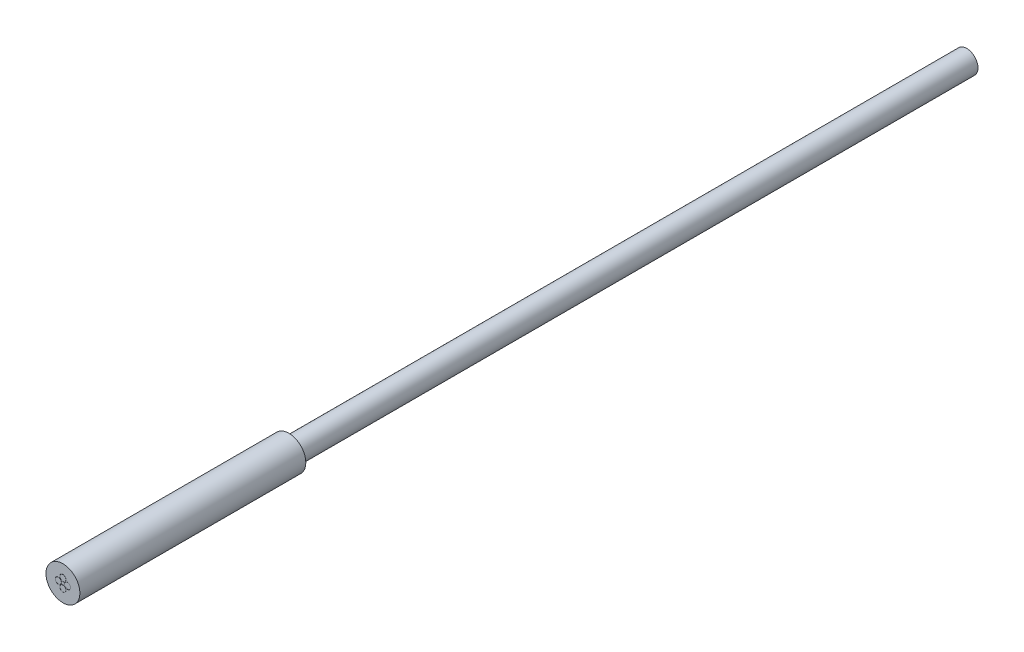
ISO-10303-21;
HEADER;
FILE_DESCRIPTION(('STEP AP214'),'2;1');
FILE_NAME('part.step','',(''),(''),'','','');
FILE_SCHEMA(('AUTOMOTIVE_DESIGN { 1 0 10303 214 1 1 1 1 }'));
ENDSEC;
DATA;
#1=APPLICATION_CONTEXT('core data for automotive mechanical design processes');
#2=APPLICATION_PROTOCOL_DEFINITION('international standard','automotive_design',2000,#1);
#3=PRODUCT_CONTEXT('',#1,'mechanical');
#4=PRODUCT('Part','Part','',(#3));
#5=PRODUCT_RELATED_PRODUCT_CATEGORY('part','',(#4));
#6=PRODUCT_DEFINITION_FORMATION('','',#4);
#7=PRODUCT_DEFINITION_CONTEXT('part definition',#1,'design');
#8=PRODUCT_DEFINITION('design','',#6,#7);
#9=PRODUCT_DEFINITION_SHAPE('','',#8);
#10=(LENGTH_UNIT() NAMED_UNIT(*) SI_UNIT(.MILLI.,.METRE.));
#11=(NAMED_UNIT(*) PLANE_ANGLE_UNIT() SI_UNIT($,.RADIAN.));
#12=(NAMED_UNIT(*) SI_UNIT($,.STERADIAN.) SOLID_ANGLE_UNIT());
#13=UNCERTAINTY_MEASURE_WITH_UNIT(LENGTH_MEASURE(1.E-05),#10,'distance_accuracy_value','');
#14=(GEOMETRIC_REPRESENTATION_CONTEXT(3) GLOBAL_UNCERTAINTY_ASSIGNED_CONTEXT((#13)) GLOBAL_UNIT_ASSIGNED_CONTEXT((#10,
#11,#12)) REPRESENTATION_CONTEXT('',''));
#15=CARTESIAN_POINT('',(0.,0.,0.));
#16=DIRECTION('',(0.,0.,1.));
#17=DIRECTION('',(1.,0.,0.));
#18=AXIS2_PLACEMENT_3D('',#15,#16,#17);
#19=CARTESIAN_POINT('',(0.,0.,-10.));
#20=DIRECTION('',(0.,0.,1.));
#21=DIRECTION('',(1.,0.,0.));
#22=AXIS2_PLACEMENT_3D('',#19,#20,#21);
#23=CYLINDRICAL_SURFACE('',#22,0.750000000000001);
#24=CARTESIAN_POINT('',(0.,0.,-10.));
#25=DIRECTION('',(0.,0.,1.));
#26=DIRECTION('',(1.,0.,0.));
#27=AXIS2_PLACEMENT_3D('',#24,#25,#26);
#28=CIRCLE('',#27,0.750000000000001);
#29=CARTESIAN_POINT('',(0.750000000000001,0.,-10.));
#30=VERTEX_POINT('',#29);
#31=EDGE_CURVE('E41',#30,#30,#28,.T.);
#32=ORIENTED_EDGE('',*,*,#31,.T.);
#33=EDGE_LOOP('',(#32));
#34=FACE_BOUND('',#33,.T.);
#35=CARTESIAN_POINT('',(0.,0.,0.));
#36=DIRECTION('',(0.,0.,1.));
#37=DIRECTION('',(1.,0.,0.));
#38=AXIS2_PLACEMENT_3D('',#35,#36,#37);
#39=CIRCLE('',#38,0.750000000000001);
#40=CARTESIAN_POINT('',(0.750000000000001,0.,0.));
#41=VERTEX_POINT('',#40);
#42=EDGE_CURVE('E37',#41,#41,#39,.T.);
#43=ORIENTED_EDGE('',*,*,#42,.F.);
#44=EDGE_LOOP('',(#43));
#45=FACE_BOUND('',#44,.T.);
#46=ADVANCED_FACE('F34',(#34,#45),#23,.T.);
#47=CARTESIAN_POINT('',(0.,0.,-10.));
#48=DIRECTION('',(0.,0.,1.));
#49=DIRECTION('',(1.,0.,0.));
#50=AXIS2_PLACEMENT_3D('',#47,#48,#49);
#51=PLANE('',#50);
#52=CARTESIAN_POINT('',(0.,0.,-10.));
#53=DIRECTION('',(0.,0.,-1.));
#54=DIRECTION('',(-1.,0.,0.));
#55=AXIS2_PLACEMENT_3D('',#52,#53,#54);
#56=CIRCLE('',#55,0.5);
#57=CARTESIAN_POINT('',(-0.5,0.,-10.));
#58=VERTEX_POINT('',#57);
#59=EDGE_CURVE('E10',#58,#58,#56,.T.);
#60=ORIENTED_EDGE('',*,*,#59,.F.);
#61=EDGE_LOOP('',(#60));
#62=FACE_BOUND('',#61,.T.);
#63=ORIENTED_EDGE('',*,*,#31,.F.);
#64=EDGE_LOOP('',(#63));
#65=FACE_BOUND('',#64,.T.);
#66=ADVANCED_FACE('F119',(#62,#65),#51,.F.);
#67=CARTESIAN_POINT('',(0.,0.,0.));
#68=DIRECTION('',(0.,0.,1.));
#69=DIRECTION('',(1.,0.,0.));
#70=AXIS2_PLACEMENT_3D('',#67,#68,#69);
#71=PLANE('',#70);
#72=CARTESIAN_POINT('',(0.,-0.201525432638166,0.));
#73=DIRECTION('',(0.,0.,1.));
#74=DIRECTION('',(1.,0.,0.));
#75=AXIS2_PLACEMENT_3D('',#72,#73,#74);
#76=CIRCLE('',#75,0.1375);
#77=CARTESIAN_POINT('',(0.1375,-0.201525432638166,0.));
#78=VERTEX_POINT('',#77);
#79=EDGE_CURVE('E75',#78,#78,#76,.T.);
#80=ORIENTED_EDGE('',*,*,#79,.F.);
#81=EDGE_LOOP('',(#80));
#82=FACE_BOUND('',#81,.T.);
#83=CARTESIAN_POINT('',(0.201525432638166,0.,0.));
#84=DIRECTION('',(0.,0.,1.));
#85=DIRECTION('',(1.,0.,0.));
#86=AXIS2_PLACEMENT_3D('',#83,#84,#85);
#87=CIRCLE('',#86,0.1375);
#88=CARTESIAN_POINT('',(0.339025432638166,0.,0.));
#89=VERTEX_POINT('',#88);
#90=EDGE_CURVE('E63',#89,#89,#87,.T.);
#91=ORIENTED_EDGE('',*,*,#90,.F.);
#92=EDGE_LOOP('',(#91));
#93=FACE_BOUND('',#92,.T.);
#94=CARTESIAN_POINT('',(-0.201525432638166,0.,0.));
#95=DIRECTION('',(0.,0.,1.));
#96=DIRECTION('',(1.,0.,0.));
#97=AXIS2_PLACEMENT_3D('',#94,#95,#96);
#98=CIRCLE('',#97,0.1375);
#99=CARTESIAN_POINT('',(-0.064025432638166,0.,0.));
#100=VERTEX_POINT('',#99);
#101=EDGE_CURVE('E87',#100,#100,#98,.T.);
#102=ORIENTED_EDGE('',*,*,#101,.F.);
#103=EDGE_LOOP('',(#102));
#104=FACE_BOUND('',#103,.T.);
#105=CARTESIAN_POINT('',(0.,0.201525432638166,0.));
#106=DIRECTION('',(0.,0.,1.));
#107=DIRECTION('',(1.,0.,0.));
#108=AXIS2_PLACEMENT_3D('',#105,#106,#107);
#109=CIRCLE('',#108,0.1375);
#110=CARTESIAN_POINT('',(0.1375,0.201525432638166,0.));
#111=VERTEX_POINT('',#110);
#112=EDGE_CURVE('E51',#111,#111,#109,.T.);
#113=ORIENTED_EDGE('',*,*,#112,.F.);
#114=EDGE_LOOP('',(#113));
#115=FACE_BOUND('',#114,.T.);
#116=ORIENTED_EDGE('',*,*,#42,.T.);
#117=EDGE_LOOP('',(#116));
#118=FACE_BOUND('',#117,.T.);
#119=ADVANCED_FACE('F115',(#82,#93,#104,#115,#118),#71,.T.);
#120=CARTESIAN_POINT('',(0.,0.,-40.));
#121=DIRECTION('',(0.,0.,1.));
#122=DIRECTION('',(1.,0.,0.));
#123=AXIS2_PLACEMENT_3D('',#120,#121,#122);
#124=CYLINDRICAL_SURFACE('',#123,0.5);
#125=CARTESIAN_POINT('',(0.,0.,-40.));
#126=DIRECTION('',(0.,0.,-1.));
#127=DIRECTION('',(-1.,0.,0.));
#128=AXIS2_PLACEMENT_3D('',#125,#126,#127);
#129=CIRCLE('',#128,0.5);
#130=CARTESIAN_POINT('',(-0.5,0.,-40.));
#131=VERTEX_POINT('',#130);
#132=EDGE_CURVE('E47',#131,#131,#129,.T.);
#133=ORIENTED_EDGE('',*,*,#132,.F.);
#134=EDGE_LOOP('',(#133));
#135=FACE_BOUND('',#134,.T.);
#136=ORIENTED_EDGE('',*,*,#59,.T.);
#137=EDGE_LOOP('',(#136));
#138=FACE_BOUND('',#137,.T.);
#139=ADVANCED_FACE('F118',(#135,#138),#124,.T.);
#140=CARTESIAN_POINT('',(0.,0.,-40.));
#141=DIRECTION('',(0.,0.,-1.));
#142=DIRECTION('',(-1.,0.,0.));
#143=AXIS2_PLACEMENT_3D('',#140,#141,#142);
#144=PLANE('',#143);
#145=ORIENTED_EDGE('',*,*,#132,.T.);
#146=EDGE_LOOP('',(#145));
#147=FACE_BOUND('',#146,.T.);
#148=ADVANCED_FACE('F142',(#147),#144,.T.);
#149=CARTESIAN_POINT('',(0.,0.201525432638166,-0.1));
#150=DIRECTION('',(0.,0.,1.));
#151=DIRECTION('',(1.,0.,0.));
#152=AXIS2_PLACEMENT_3D('',#149,#150,#151);
#153=CYLINDRICAL_SURFACE('',#152,0.1375);
#154=CARTESIAN_POINT('',(0.,0.201525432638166,-0.1));
#155=DIRECTION('',(0.,0.,1.));
#156=DIRECTION('',(1.,0.,0.));
#157=AXIS2_PLACEMENT_3D('',#154,#155,#156);
#158=CIRCLE('',#157,0.1375);
#159=CARTESIAN_POINT('',(0.1375,0.201525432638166,-0.1));
#160=VERTEX_POINT('',#159);
#161=EDGE_CURVE('E50',#160,#160,#158,.T.);
#162=ORIENTED_EDGE('',*,*,#161,.F.);
#163=EDGE_LOOP('',(#162));
#164=FACE_BOUND('',#163,.T.);
#165=ORIENTED_EDGE('',*,*,#112,.T.);
#166=EDGE_LOOP('',(#165));
#167=FACE_BOUND('',#166,.T.);
#168=ADVANCED_FACE('F146',(#164,#167),#153,.F.);
#169=CARTESIAN_POINT('',(0.,0.201525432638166,-0.1));
#170=DIRECTION('',(0.,0.,1.));
#171=DIRECTION('',(1.,0.,0.));
#172=AXIS2_PLACEMENT_3D('',#169,#170,#171);
#173=PLANE('',#172);
#174=CARTESIAN_POINT('',(0.,0.201525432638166,-0.1));
#175=DIRECTION('',(0.,0.,1.));
#176=DIRECTION('',(1.,0.,0.));
#177=AXIS2_PLACEMENT_3D('',#174,#175,#176);
#178=CIRCLE('',#177,0.1325);
#179=CARTESIAN_POINT('',(0.1325,0.201525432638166,-0.1));
#180=VERTEX_POINT('',#179);
#181=EDGE_CURVE('E54',#180,#180,#178,.T.);
#182=ORIENTED_EDGE('',*,*,#181,.F.);
#183=EDGE_LOOP('',(#182));
#184=FACE_BOUND('',#183,.T.);
#185=ORIENTED_EDGE('',*,*,#161,.T.);
#186=EDGE_LOOP('',(#185));
#187=FACE_BOUND('',#186,.T.);
#188=ADVANCED_FACE('F150',(#184,#187),#173,.T.);
#189=CARTESIAN_POINT('',(0.,0.201525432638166,-0.1));
#190=DIRECTION('',(0.,0.,1.));
#191=DIRECTION('',(1.,0.,0.));
#192=AXIS2_PLACEMENT_3D('',#189,#190,#191);
#193=CYLINDRICAL_SURFACE('',#192,0.1325);
#194=ORIENTED_EDGE('',*,*,#181,.T.);
#195=EDGE_LOOP('',(#194));
#196=FACE_BOUND('',#195,.T.);
#197=CARTESIAN_POINT('',(0.,0.201525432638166,0.));
#198=DIRECTION('',(0.,0.,1.));
#199=DIRECTION('',(1.,0.,0.));
#200=AXIS2_PLACEMENT_3D('',#197,#198,#199);
#201=CIRCLE('',#200,0.1325);
#202=CARTESIAN_POINT('',(0.1325,0.201525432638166,0.));
#203=VERTEX_POINT('',#202);
#204=EDGE_CURVE('E57',#203,#203,#201,.T.);
#205=ORIENTED_EDGE('',*,*,#204,.F.);
#206=EDGE_LOOP('',(#205));
#207=FACE_BOUND('',#206,.T.);
#208=ADVANCED_FACE('F111',(#196,#207),#193,.T.);
#209=CARTESIAN_POINT('',(-0.201525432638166,0.,-0.1));
#210=DIRECTION('',(0.,0.,1.));
#211=DIRECTION('',(1.,0.,0.));
#212=AXIS2_PLACEMENT_3D('',#209,#210,#211);
#213=CYLINDRICAL_SURFACE('',#212,0.1375);
#214=CARTESIAN_POINT('',(-0.201525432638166,0.,-0.1));
#215=DIRECTION('',(0.,0.,1.));
#216=DIRECTION('',(1.,0.,0.));
#217=AXIS2_PLACEMENT_3D('',#214,#215,#216);
#218=CIRCLE('',#217,0.1375);
#219=CARTESIAN_POINT('',(-0.064025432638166,0.,-0.1));
#220=VERTEX_POINT('',#219);
#221=EDGE_CURVE('E84',#220,#220,#218,.T.);
#222=ORIENTED_EDGE('',*,*,#221,.F.);
#223=EDGE_LOOP('',(#222));
#224=FACE_BOUND('',#223,.T.);
#225=ORIENTED_EDGE('',*,*,#101,.T.);
#226=EDGE_LOOP('',(#225));
#227=FACE_BOUND('',#226,.T.);
#228=ADVANCED_FACE('F105',(#224,#227),#213,.F.);
#229=CARTESIAN_POINT('',(-0.201525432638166,0.,-0.1));
#230=DIRECTION('',(0.,0.,1.));
#231=DIRECTION('',(1.,0.,0.));
#232=AXIS2_PLACEMENT_3D('',#229,#230,#231);
#233=PLANE('',#232);
#234=CARTESIAN_POINT('',(-0.201525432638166,0.,-0.1));
#235=DIRECTION('',(0.,0.,1.));
#236=DIRECTION('',(1.,0.,0.));
#237=AXIS2_PLACEMENT_3D('',#234,#235,#236);
#238=CIRCLE('',#237,0.1325);
#239=CARTESIAN_POINT('',(-0.069025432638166,0.,-0.1));
#240=VERTEX_POINT('',#239);
#241=EDGE_CURVE('E90',#240,#240,#238,.T.);
#242=ORIENTED_EDGE('',*,*,#241,.F.);
#243=EDGE_LOOP('',(#242));
#244=FACE_BOUND('',#243,.T.);
#245=ORIENTED_EDGE('',*,*,#221,.T.);
#246=EDGE_LOOP('',(#245));
#247=FACE_BOUND('',#246,.T.);
#248=ADVANCED_FACE('F102',(#244,#247),#233,.T.);
#249=CARTESIAN_POINT('',(-0.201525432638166,0.,-0.1));
#250=DIRECTION('',(0.,0.,1.));
#251=DIRECTION('',(1.,0.,0.));
#252=AXIS2_PLACEMENT_3D('',#249,#250,#251);
#253=CYLINDRICAL_SURFACE('',#252,0.1325);
#254=ORIENTED_EDGE('',*,*,#241,.T.);
#255=EDGE_LOOP('',(#254));
#256=FACE_BOUND('',#255,.T.);
#257=CARTESIAN_POINT('',(-0.201525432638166,0.,0.));
#258=DIRECTION('',(0.,0.,1.));
#259=DIRECTION('',(1.,0.,0.));
#260=AXIS2_PLACEMENT_3D('',#257,#258,#259);
#261=CIRCLE('',#260,0.1325);
#262=CARTESIAN_POINT('',(-0.069025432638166,0.,0.));
#263=VERTEX_POINT('',#262);
#264=EDGE_CURVE('E93',#263,#263,#261,.T.);
#265=ORIENTED_EDGE('',*,*,#264,.F.);
#266=EDGE_LOOP('',(#265));
#267=FACE_BOUND('',#266,.T.);
#268=ADVANCED_FACE('F99',(#256,#267),#253,.T.);
#269=CARTESIAN_POINT('',(0.201525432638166,0.,-0.1));
#270=DIRECTION('',(0.,0.,1.));
#271=DIRECTION('',(1.,0.,0.));
#272=AXIS2_PLACEMENT_3D('',#269,#270,#271);
#273=CYLINDRICAL_SURFACE('',#272,0.1375);
#274=CARTESIAN_POINT('',(0.201525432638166,0.,-0.1));
#275=DIRECTION('',(0.,0.,1.));
#276=DIRECTION('',(1.,0.,0.));
#277=AXIS2_PLACEMENT_3D('',#274,#275,#276);
#278=CIRCLE('',#277,0.1375);
#279=CARTESIAN_POINT('',(0.339025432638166,0.,-0.1));
#280=VERTEX_POINT('',#279);
#281=EDGE_CURVE('E60',#280,#280,#278,.T.);
#282=ORIENTED_EDGE('',*,*,#281,.F.);
#283=EDGE_LOOP('',(#282));
#284=FACE_BOUND('',#283,.T.);
#285=ORIENTED_EDGE('',*,*,#90,.T.);
#286=EDGE_LOOP('',(#285));
#287=FACE_BOUND('',#286,.T.);
#288=ADVANCED_FACE('F158',(#284,#287),#273,.F.);
#289=CARTESIAN_POINT('',(0.201525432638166,0.,-0.1));
#290=DIRECTION('',(0.,0.,1.));
#291=DIRECTION('',(1.,0.,0.));
#292=AXIS2_PLACEMENT_3D('',#289,#290,#291);
#293=PLANE('',#292);
#294=CARTESIAN_POINT('',(0.201525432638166,0.,-0.1));
#295=DIRECTION('',(0.,0.,1.));
#296=DIRECTION('',(1.,0.,0.));
#297=AXIS2_PLACEMENT_3D('',#294,#295,#296);
#298=CIRCLE('',#297,0.1325);
#299=CARTESIAN_POINT('',(0.334025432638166,0.,-0.1));
#300=VERTEX_POINT('',#299);
#301=EDGE_CURVE('E66',#300,#300,#298,.T.);
#302=ORIENTED_EDGE('',*,*,#301,.F.);
#303=EDGE_LOOP('',(#302));
#304=FACE_BOUND('',#303,.T.);
#305=ORIENTED_EDGE('',*,*,#281,.T.);
#306=EDGE_LOOP('',(#305));
#307=FACE_BOUND('',#306,.T.);
#308=ADVANCED_FACE('F161',(#304,#307),#293,.T.);
#309=CARTESIAN_POINT('',(0.201525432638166,0.,-0.1));
#310=DIRECTION('',(0.,0.,1.));
#311=DIRECTION('',(1.,0.,0.));
#312=AXIS2_PLACEMENT_3D('',#309,#310,#311);
#313=CYLINDRICAL_SURFACE('',#312,0.1325);
#314=ORIENTED_EDGE('',*,*,#301,.T.);
#315=EDGE_LOOP('',(#314));
#316=FACE_BOUND('',#315,.T.);
#317=CARTESIAN_POINT('',(0.201525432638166,0.,0.));
#318=DIRECTION('',(0.,0.,1.));
#319=DIRECTION('',(1.,0.,0.));
#320=AXIS2_PLACEMENT_3D('',#317,#318,#319);
#321=CIRCLE('',#320,0.1325);
#322=CARTESIAN_POINT('',(0.334025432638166,0.,0.));
#323=VERTEX_POINT('',#322);
#324=EDGE_CURVE('E69',#323,#323,#321,.T.);
#325=ORIENTED_EDGE('',*,*,#324,.F.);
#326=EDGE_LOOP('',(#325));
#327=FACE_BOUND('',#326,.T.);
#328=ADVANCED_FACE('F165',(#316,#327),#313,.T.);
#329=CARTESIAN_POINT('',(0.,-0.201525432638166,-0.1));
#330=DIRECTION('',(0.,0.,1.));
#331=DIRECTION('',(1.,0.,0.));
#332=AXIS2_PLACEMENT_3D('',#329,#330,#331);
#333=CYLINDRICAL_SURFACE('',#332,0.1375);
#334=CARTESIAN_POINT('',(0.,-0.201525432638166,-0.1));
#335=DIRECTION('',(0.,0.,1.));
#336=DIRECTION('',(1.,0.,0.));
#337=AXIS2_PLACEMENT_3D('',#334,#335,#336);
#338=CIRCLE('',#337,0.1375);
#339=CARTESIAN_POINT('',(0.1375,-0.201525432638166,-0.1));
#340=VERTEX_POINT('',#339);
#341=EDGE_CURVE('E72',#340,#340,#338,.T.);
#342=ORIENTED_EDGE('',*,*,#341,.F.);
#343=EDGE_LOOP('',(#342));
#344=FACE_BOUND('',#343,.T.);
#345=ORIENTED_EDGE('',*,*,#79,.T.);
#346=EDGE_LOOP('',(#345));
#347=FACE_BOUND('',#346,.T.);
#348=ADVANCED_FACE('F169',(#344,#347),#333,.F.);
#349=CARTESIAN_POINT('',(0.,-0.201525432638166,-0.1));
#350=DIRECTION('',(0.,0.,1.));
#351=DIRECTION('',(1.,0.,0.));
#352=AXIS2_PLACEMENT_3D('',#349,#350,#351);
#353=PLANE('',#352);
#354=CARTESIAN_POINT('',(0.,-0.201525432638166,-0.1));
#355=DIRECTION('',(0.,0.,1.));
#356=DIRECTION('',(1.,0.,0.));
#357=AXIS2_PLACEMENT_3D('',#354,#355,#356);
#358=CIRCLE('',#357,0.1325);
#359=CARTESIAN_POINT('',(0.1325,-0.201525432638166,-0.1));
#360=VERTEX_POINT('',#359);
#361=EDGE_CURVE('E78',#360,#360,#358,.T.);
#362=ORIENTED_EDGE('',*,*,#361,.F.);
#363=EDGE_LOOP('',(#362));
#364=FACE_BOUND('',#363,.T.);
#365=ORIENTED_EDGE('',*,*,#341,.T.);
#366=EDGE_LOOP('',(#365));
#367=FACE_BOUND('',#366,.T.);
#368=ADVANCED_FACE('F173',(#364,#367),#353,.T.);
#369=CARTESIAN_POINT('',(0.,-0.201525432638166,-0.1));
#370=DIRECTION('',(0.,0.,1.));
#371=DIRECTION('',(1.,0.,0.));
#372=AXIS2_PLACEMENT_3D('',#369,#370,#371);
#373=CYLINDRICAL_SURFACE('',#372,0.1325);
#374=ORIENTED_EDGE('',*,*,#361,.T.);
#375=EDGE_LOOP('',(#374));
#376=FACE_BOUND('',#375,.T.);
#377=CARTESIAN_POINT('',(0.,-0.201525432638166,0.));
#378=DIRECTION('',(0.,0.,1.));
#379=DIRECTION('',(1.,0.,0.));
#380=AXIS2_PLACEMENT_3D('',#377,#378,#379);
#381=CIRCLE('',#380,0.1325);
#382=CARTESIAN_POINT('',(0.1325,-0.201525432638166,0.));
#383=VERTEX_POINT('',#382);
#384=EDGE_CURVE('E81',#383,#383,#381,.T.);
#385=ORIENTED_EDGE('',*,*,#384,.F.);
#386=EDGE_LOOP('',(#385));
#387=FACE_BOUND('',#386,.T.);
#388=ADVANCED_FACE('F177',(#376,#387),#373,.T.);
#389=ORIENTED_EDGE('',*,*,#204,.T.);
#390=EDGE_LOOP('',(#389));
#391=FACE_BOUND('',#390,.T.);
#392=ADVANCED_FACE('F122',(#391),#71,.T.);
#393=ORIENTED_EDGE('',*,*,#264,.T.);
#394=EDGE_LOOP('',(#393));
#395=FACE_BOUND('',#394,.T.);
#396=ADVANCED_FACE('F217',(#395),#71,.T.);
#397=ORIENTED_EDGE('',*,*,#324,.T.);
#398=EDGE_LOOP('',(#397));
#399=FACE_BOUND('',#398,.T.);
#400=ADVANCED_FACE('F224',(#399),#71,.T.);
#401=ORIENTED_EDGE('',*,*,#384,.T.);
#402=EDGE_LOOP('',(#401));
#403=FACE_BOUND('',#402,.T.);
#404=ADVANCED_FACE('F121',(#403),#71,.T.);
#405=CLOSED_SHELL('',(#46,#66,#119,#139,#148,#168,#188,#208,#228,#248,#268,#288,#308,#328,#348,
#368,#388,#392,#396,#400,#404));
#406=MANIFOLD_SOLID_BREP('B2',#405);
#407=ADVANCED_BREP_SHAPE_REPRESENTATION('',(#18,#406),#14);
#408=SHAPE_DEFINITION_REPRESENTATION(#9,#407);
ENDSEC;
END-ISO-10303-21;
